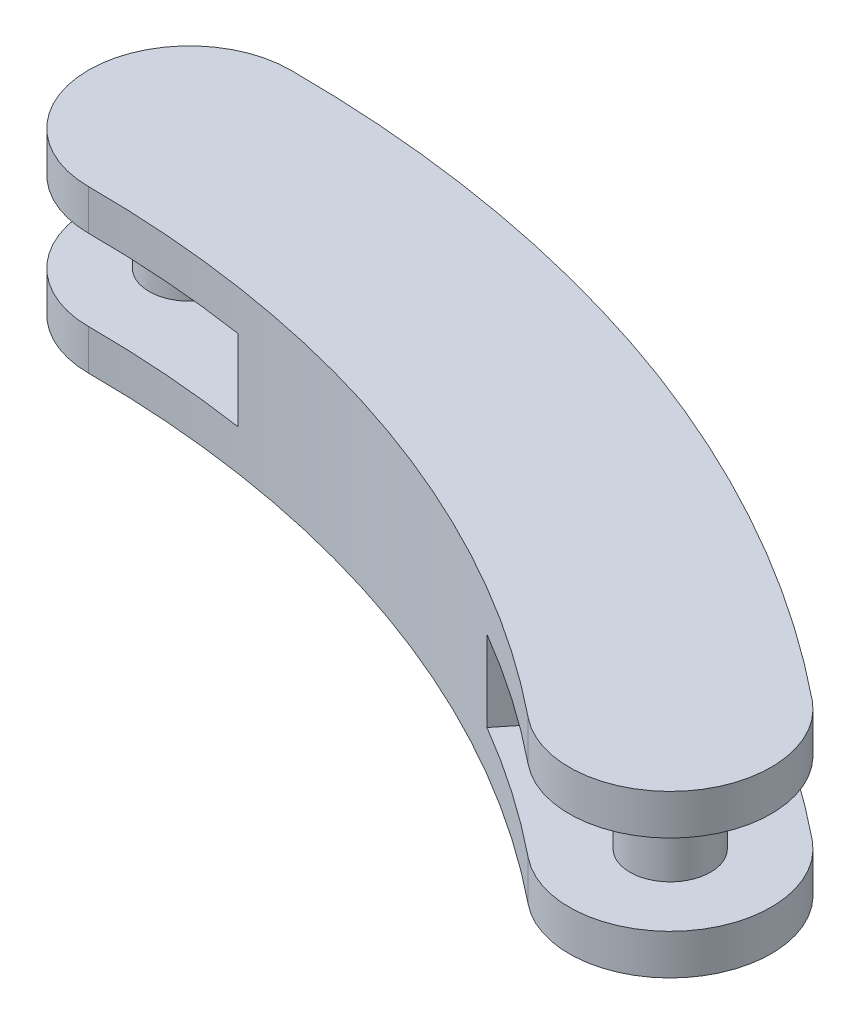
ISO-10303-21;
HEADER;
FILE_DESCRIPTION(('STEP AP214'),'2;1');
FILE_NAME('part.step','',(''),(''),'','','');
FILE_SCHEMA(('AUTOMOTIVE_DESIGN { 1 0 10303 214 1 1 1 1 }'));
ENDSEC;
DATA;
#1=APPLICATION_CONTEXT('core data for automotive mechanical design processes');
#2=APPLICATION_PROTOCOL_DEFINITION('international standard','automotive_design',2000,#1);
#3=PRODUCT_CONTEXT('',#1,'mechanical');
#4=PRODUCT('Part','Part','',(#3));
#5=PRODUCT_RELATED_PRODUCT_CATEGORY('part','',(#4));
#6=PRODUCT_DEFINITION_FORMATION('','',#4);
#7=PRODUCT_DEFINITION_CONTEXT('part definition',#1,'design');
#8=PRODUCT_DEFINITION('design','',#6,#7);
#9=PRODUCT_DEFINITION_SHAPE('','',#8);
#10=(LENGTH_UNIT() NAMED_UNIT(*) SI_UNIT(.MILLI.,.METRE.));
#11=(NAMED_UNIT(*) PLANE_ANGLE_UNIT() SI_UNIT($,.RADIAN.));
#12=(NAMED_UNIT(*) SI_UNIT($,.STERADIAN.) SOLID_ANGLE_UNIT());
#13=UNCERTAINTY_MEASURE_WITH_UNIT(LENGTH_MEASURE(1.E-05),#10,'distance_accuracy_value','');
#14=(GEOMETRIC_REPRESENTATION_CONTEXT(3) GLOBAL_UNCERTAINTY_ASSIGNED_CONTEXT((#13)) GLOBAL_UNIT_ASSIGNED_CONTEXT((#10,
#11,#12)) REPRESENTATION_CONTEXT('',''));
#15=CARTESIAN_POINT('',(0.,0.,0.));
#16=DIRECTION('',(0.,0.,1.));
#17=DIRECTION('',(1.,0.,0.));
#18=AXIS2_PLACEMENT_3D('',#15,#16,#17);
#19=CARTESIAN_POINT('',(0.,40.,227.93076923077));
#20=DIRECTION('',(0.,-1.,0.));
#21=DIRECTION('',(0.,0.,-1.));
#22=AXIS2_PLACEMENT_3D('',#19,#20,#21);
#23=CYLINDRICAL_SURFACE('',#22,267.93076923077);
#24=CARTESIAN_POINT('',(0.,10.,227.93076923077));
#25=DIRECTION('',(0.,1.,0.));
#26=DIRECTION('',(0.,0.,1.));
#27=AXIS2_PLACEMENT_3D('',#24,#25,#26);
#28=CIRCLE('',#27,267.93076923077);
#29=CARTESIAN_POINT('',(168.296630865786,10.,19.4526141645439));
#30=VERTEX_POINT('',#29);
#31=CARTESIAN_POINT('',(135.286366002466,10.,-3.33638423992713));
#32=VERTEX_POINT('',#31);
#33=EDGE_CURVE('E273',#30,#32,#28,.T.);
#34=ORIENTED_EDGE('',*,*,#33,.T.);
#35=DIRECTION('',(0.,-1.,0.));
#36=VECTOR('',#35,1.);
#37=CARTESIAN_POINT('',(135.286366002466,40.,-3.33638423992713));
#38=LINE('',#37,#36);
#39=CARTESIAN_POINT('',(135.286366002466,30.,-3.33638423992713));
#40=VERTEX_POINT('',#39);
#41=EDGE_CURVE('E138',#32,#40,#38,.F.);
#42=ORIENTED_EDGE('',*,*,#41,.T.);
#43=CARTESIAN_POINT('',(0.,30.,227.93076923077));
#44=DIRECTION('',(0.,1.,0.));
#45=DIRECTION('',(-1.,0.,0.));
#46=AXIS2_PLACEMENT_3D('',#43,#44,#45);
#47=CIRCLE('',#46,267.93076923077);
#48=CARTESIAN_POINT('',(168.296630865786,30.,19.4526141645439));
#49=VERTEX_POINT('',#48);
#50=EDGE_CURVE('E124',#49,#40,#47,.T.);
#51=ORIENTED_EDGE('',*,*,#50,.F.);
#52=DIRECTION('',(0.,-1.,0.));
#53=VECTOR('',#52,1.);
#54=CARTESIAN_POINT('',(168.296630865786,40.,19.452614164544));
#55=LINE('',#54,#53);
#56=CARTESIAN_POINT('',(168.296630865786,40.,19.452614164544));
#57=VERTEX_POINT('',#56);
#58=EDGE_CURVE('E135',#57,#49,#55,.T.);
#59=ORIENTED_EDGE('',*,*,#58,.F.);
#60=CARTESIAN_POINT('',(0.,40.,227.93076923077));
#61=DIRECTION('',(0.,-1.,0.));
#62=DIRECTION('',(0.,0.,-1.));
#63=AXIS2_PLACEMENT_3D('',#60,#61,#62);
#64=CIRCLE('',#63,267.93076923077);
#65=CARTESIAN_POINT('',(0.,40.,-39.9999999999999));
#66=VERTEX_POINT('',#65);
#67=EDGE_CURVE('E193',#66,#57,#64,.T.);
#68=ORIENTED_EDGE('',*,*,#67,.F.);
#69=DIRECTION('',(0.,-1.,0.));
#70=VECTOR('',#69,1.);
#71=CARTESIAN_POINT('',(0.,40.,-39.9999999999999));
#72=LINE('',#71,#70);
#73=CARTESIAN_POINT('',(0.,30.,-40.));
#74=VERTEX_POINT('',#73);
#75=EDGE_CURVE('E146',#66,#74,#72,.T.);
#76=ORIENTED_EDGE('',*,*,#75,.T.);
#77=CARTESIAN_POINT('',(0.,30.,227.93076923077));
#78=DIRECTION('',(0.,-1.,0.));
#79=DIRECTION('',(0.,0.,-1.));
#80=AXIS2_PLACEMENT_3D('',#77,#78,#79);
#81=CIRCLE('',#80,267.93076923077);
#82=CARTESIAN_POINT('',(40.,30.,-36.9973287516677));
#83=VERTEX_POINT('',#82);
#84=EDGE_CURVE('E185',#83,#74,#81,.F.);
#85=ORIENTED_EDGE('',*,*,#84,.F.);
#86=DIRECTION('',(0.,-1.,0.));
#87=VECTOR('',#86,1.);
#88=CARTESIAN_POINT('',(40.,40.,-36.9973287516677));
#89=LINE('',#88,#87);
#90=CARTESIAN_POINT('',(40.,10.,-36.9973287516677));
#91=VERTEX_POINT('',#90);
#92=EDGE_CURVE('E187',#91,#83,#89,.F.);
#93=ORIENTED_EDGE('',*,*,#92,.F.);
#94=CARTESIAN_POINT('',(0.,10.,227.93076923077));
#95=DIRECTION('',(0.,-1.,0.));
#96=DIRECTION('',(0.,0.,-1.));
#97=AXIS2_PLACEMENT_3D('',#94,#95,#96);
#98=CIRCLE('',#97,267.93076923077);
#99=CARTESIAN_POINT('',(0.,10.,-40.));
#100=VERTEX_POINT('',#99);
#101=EDGE_CURVE('E157',#91,#100,#98,.F.);
#102=ORIENTED_EDGE('',*,*,#101,.T.);
#103=CARTESIAN_POINT('',(0.,0.,-39.9999999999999));
#104=VERTEX_POINT('',#103);
#105=EDGE_CURVE('E143',#100,#104,#72,.T.);
#106=ORIENTED_EDGE('',*,*,#105,.T.);
#107=CARTESIAN_POINT('',(0.,0.,227.93076923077));
#108=DIRECTION('',(0.,-1.,0.));
#109=DIRECTION('',(0.,0.,-1.));
#110=AXIS2_PLACEMENT_3D('',#107,#108,#109);
#111=CIRCLE('',#110,267.93076923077);
#112=CARTESIAN_POINT('',(168.296630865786,0.,19.452614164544));
#113=VERTEX_POINT('',#112);
#114=EDGE_CURVE('E202',#104,#113,#111,.T.);
#115=ORIENTED_EDGE('',*,*,#114,.T.);
#116=EDGE_CURVE('E144',#30,#113,#55,.T.);
#117=ORIENTED_EDGE('',*,*,#116,.F.);
#118=EDGE_LOOP('',(#34,#42,#51,#59,#68,#76,#85,#93,#102,#106,#115,#117));
#119=FACE_BOUND('',#118,.T.);
#120=ADVANCED_FACE('F33',(#119),#23,.F.);
#121=CARTESIAN_POINT('',(0.,40.,227.93076923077));
#122=DIRECTION('',(0.,-1.,0.));
#123=DIRECTION('',(0.,0.,-1.));
#124=AXIS2_PLACEMENT_3D('',#121,#122,#123);
#125=CYLINDRICAL_SURFACE('',#124,317.93076923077);
#126=CARTESIAN_POINT('',(0.,10.,227.93076923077));
#127=DIRECTION('',(0.,1.,0.));
#128=DIRECTION('',(0.,0.,1.));
#129=AXIS2_PLACEMENT_3D('',#126,#127,#128);
#130=CIRCLE('',#129,317.93076923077);
#131=CARTESIAN_POINT('',(199.703369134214,10.,-19.452614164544));
#132=VERTEX_POINT('',#131);
#133=CARTESIAN_POINT('',(166.992324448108,10.,-42.6122728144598));
#134=VERTEX_POINT('',#133);
#135=EDGE_CURVE('E163',#132,#134,#130,.T.);
#136=ORIENTED_EDGE('',*,*,#135,.F.);
#137=DIRECTION('',(0.,-1.,0.));
#138=VECTOR('',#137,1.);
#139=CARTESIAN_POINT('',(199.703369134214,40.,-19.452614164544));
#140=LINE('',#139,#138);
#141=CARTESIAN_POINT('',(199.703369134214,0.,-19.452614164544));
#142=VERTEX_POINT('',#141);
#143=EDGE_CURVE('E211',#132,#142,#140,.T.);
#144=ORIENTED_EDGE('',*,*,#143,.T.);
#145=CARTESIAN_POINT('',(0.,0.,227.93076923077));
#146=DIRECTION('',(0.,1.,0.));
#147=DIRECTION('',(0.,0.,-1.));
#148=AXIS2_PLACEMENT_3D('',#145,#146,#147);
#149=CIRCLE('',#148,317.93076923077);
#150=CARTESIAN_POINT('',(0.,0.,-90.));
#151=VERTEX_POINT('',#150);
#152=EDGE_CURVE('E194',#142,#151,#149,.T.);
#153=ORIENTED_EDGE('',*,*,#152,.T.);
#154=DIRECTION('',(0.,-1.,0.));
#155=VECTOR('',#154,1.);
#156=CARTESIAN_POINT('',(0.,40.,-90.));
#157=LINE('',#156,#155);
#158=CARTESIAN_POINT('',(0.,10.,-90.));
#159=VERTEX_POINT('',#158);
#160=EDGE_CURVE('E199',#159,#151,#157,.T.);
#161=ORIENTED_EDGE('',*,*,#160,.F.);
#162=CARTESIAN_POINT('',(0.,10.,227.93076923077));
#163=DIRECTION('',(0.,-1.,0.));
#164=DIRECTION('',(0.,0.,-1.));
#165=AXIS2_PLACEMENT_3D('',#162,#163,#164);
#166=CIRCLE('',#165,317.93076923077);
#167=CARTESIAN_POINT('',(40.,10.,-87.4736917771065));
#168=VERTEX_POINT('',#167);
#169=EDGE_CURVE('E175',#159,#168,#166,.T.);
#170=ORIENTED_EDGE('',*,*,#169,.T.);
#171=DIRECTION('',(0.,-1.,0.));
#172=VECTOR('',#171,1.);
#173=CARTESIAN_POINT('',(40.,40.,-87.4736917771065));
#174=LINE('',#173,#172);
#175=CARTESIAN_POINT('',(40.,30.,-87.4736917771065));
#176=VERTEX_POINT('',#175);
#177=EDGE_CURVE('E41',#176,#168,#174,.T.);
#178=ORIENTED_EDGE('',*,*,#177,.F.);
#179=CARTESIAN_POINT('',(0.,30.,227.93076923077));
#180=DIRECTION('',(0.,-1.,0.));
#181=DIRECTION('',(0.,0.,-1.));
#182=AXIS2_PLACEMENT_3D('',#179,#180,#181);
#183=CIRCLE('',#182,317.93076923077);
#184=CARTESIAN_POINT('',(0.,30.,-90.));
#185=VERTEX_POINT('',#184);
#186=EDGE_CURVE('E156',#185,#176,#183,.T.);
#187=ORIENTED_EDGE('',*,*,#186,.F.);
#188=CARTESIAN_POINT('',(0.,40.,-90.));
#189=VERTEX_POINT('',#188);
#190=EDGE_CURVE('E209',#189,#185,#157,.T.);
#191=ORIENTED_EDGE('',*,*,#190,.F.);
#192=CARTESIAN_POINT('',(0.,40.,227.93076923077));
#193=DIRECTION('',(0.,1.,0.));
#194=DIRECTION('',(0.,0.,-1.));
#195=AXIS2_PLACEMENT_3D('',#192,#193,#194);
#196=CIRCLE('',#195,317.93076923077);
#197=CARTESIAN_POINT('',(199.703369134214,40.,-19.452614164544));
#198=VERTEX_POINT('',#197);
#199=EDGE_CURVE('E197',#198,#189,#196,.T.);
#200=ORIENTED_EDGE('',*,*,#199,.F.);
#201=CARTESIAN_POINT('',(199.703369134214,30.,-19.452614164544));
#202=VERTEX_POINT('',#201);
#203=EDGE_CURVE('E148',#198,#202,#140,.T.);
#204=ORIENTED_EDGE('',*,*,#203,.T.);
#205=CARTESIAN_POINT('',(0.,30.,227.93076923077));
#206=DIRECTION('',(0.,1.,0.));
#207=DIRECTION('',(-1.,0.,0.));
#208=AXIS2_PLACEMENT_3D('',#205,#206,#207);
#209=CIRCLE('',#208,317.93076923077);
#210=CARTESIAN_POINT('',(166.992324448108,30.,-42.6122728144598));
#211=VERTEX_POINT('',#210);
#212=EDGE_CURVE('E48',#202,#211,#209,.T.);
#213=ORIENTED_EDGE('',*,*,#212,.T.);
#214=DIRECTION('',(0.,-1.,0.));
#215=VECTOR('',#214,1.);
#216=CARTESIAN_POINT('',(166.992324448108,40.,-42.6122728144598));
#217=LINE('',#216,#215);
#218=EDGE_CURVE('E11',#134,#211,#217,.F.);
#219=ORIENTED_EDGE('',*,*,#218,.F.);
#220=EDGE_LOOP('',(#136,#144,#153,#161,#170,#178,#187,#191,#200,#204,#213,#219));
#221=FACE_BOUND('',#220,.T.);
#222=ADVANCED_FACE('F223',(#221),#125,.T.);
#223=CARTESIAN_POINT('',(184.,40.,0.));
#224=DIRECTION('',(0.,-1.,0.));
#225=DIRECTION('',(0.,0.,-1.));
#226=AXIS2_PLACEMENT_3D('',#223,#224,#225);
#227=CYLINDRICAL_SURFACE('',#226,25.);
#228=CARTESIAN_POINT('',(184.,10.,0.));
#229=DIRECTION('',(0.,1.,0.));
#230=DIRECTION('',(0.,0.,1.));
#231=AXIS2_PLACEMENT_3D('',#228,#229,#230);
#232=CIRCLE('',#231,25.);
#233=EDGE_CURVE('E160',#30,#132,#232,.T.);
#234=ORIENTED_EDGE('',*,*,#233,.F.);
#235=ORIENTED_EDGE('',*,*,#116,.T.);
#236=CARTESIAN_POINT('',(184.,0.,0.));
#237=DIRECTION('',(0.,1.,0.));
#238=DIRECTION('',(0.,0.,1.));
#239=AXIS2_PLACEMENT_3D('',#236,#237,#238);
#240=CIRCLE('',#239,25.);
#241=EDGE_CURVE('E205',#113,#142,#240,.T.);
#242=ORIENTED_EDGE('',*,*,#241,.T.);
#243=ORIENTED_EDGE('',*,*,#143,.F.);
#244=EDGE_LOOP('',(#234,#235,#242,#243));
#245=FACE_BOUND('',#244,.T.);
#246=ADVANCED_FACE('F256',(#245),#227,.T.);
#247=CARTESIAN_POINT('',(0.,40.,-65.));
#248=DIRECTION('',(0.,-1.,0.));
#249=DIRECTION('',(0.,0.,-1.));
#250=AXIS2_PLACEMENT_3D('',#247,#248,#249);
#251=CYLINDRICAL_SURFACE('',#250,25.);
#252=CARTESIAN_POINT('',(0.,30.,-65.));
#253=DIRECTION('',(0.,-1.,0.));
#254=DIRECTION('',(0.,0.,-1.));
#255=AXIS2_PLACEMENT_3D('',#252,#253,#254);
#256=CIRCLE('',#255,25.);
#257=EDGE_CURVE('E183',#74,#185,#256,.T.);
#258=ORIENTED_EDGE('',*,*,#257,.F.);
#259=ORIENTED_EDGE('',*,*,#75,.F.);
#260=CARTESIAN_POINT('',(0.,40.,-65.));
#261=DIRECTION('',(0.,1.,0.));
#262=DIRECTION('',(0.,0.,1.));
#263=AXIS2_PLACEMENT_3D('',#260,#261,#262);
#264=CIRCLE('',#263,25.);
#265=EDGE_CURVE('E190',#189,#66,#264,.T.);
#266=ORIENTED_EDGE('',*,*,#265,.F.);
#267=ORIENTED_EDGE('',*,*,#190,.T.);
#268=EDGE_LOOP('',(#258,#259,#266,#267));
#269=FACE_BOUND('',#268,.T.);
#270=ADVANCED_FACE('F35',(#269),#251,.T.);
#271=ORIENTED_EDGE('',*,*,#105,.F.);
#272=CARTESIAN_POINT('',(0.,10.,-65.));
#273=DIRECTION('',(0.,-1.,0.));
#274=DIRECTION('',(0.,0.,-1.));
#275=AXIS2_PLACEMENT_3D('',#272,#273,#274);
#276=CIRCLE('',#275,25.);
#277=EDGE_CURVE('E178',#100,#159,#276,.T.);
#278=ORIENTED_EDGE('',*,*,#277,.T.);
#279=ORIENTED_EDGE('',*,*,#160,.T.);
#280=CARTESIAN_POINT('',(0.,0.,-65.));
#281=DIRECTION('',(0.,1.,0.));
#282=DIRECTION('',(0.,0.,1.));
#283=AXIS2_PLACEMENT_3D('',#280,#281,#282);
#284=CIRCLE('',#283,25.);
#285=EDGE_CURVE('E189',#151,#104,#284,.T.);
#286=ORIENTED_EDGE('',*,*,#285,.T.);
#287=EDGE_LOOP('',(#271,#278,#279,#286));
#288=FACE_BOUND('',#287,.T.);
#289=ADVANCED_FACE('F219',(#288),#251,.T.);
#290=CARTESIAN_POINT('',(0.,40.,81.4653846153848));
#291=DIRECTION('',(0.,1.,0.));
#292=DIRECTION('',(0.,0.,1.));
#293=AXIS2_PLACEMENT_3D('',#290,#291,#292);
#294=PLANE('',#293);
#295=ORIENTED_EDGE('',*,*,#265,.T.);
#296=ORIENTED_EDGE('',*,*,#67,.T.);
#297=CARTESIAN_POINT('',(184.,40.,0.));
#298=DIRECTION('',(0.,1.,0.));
#299=DIRECTION('',(0.,0.,1.));
#300=AXIS2_PLACEMENT_3D('',#297,#298,#299);
#301=CIRCLE('',#300,25.);
#302=EDGE_CURVE('E142',#57,#198,#301,.T.);
#303=ORIENTED_EDGE('',*,*,#302,.T.);
#304=ORIENTED_EDGE('',*,*,#199,.T.);
#305=EDGE_LOOP('',(#295,#296,#303,#304));
#306=FACE_BOUND('',#305,.T.);
#307=ADVANCED_FACE('F243',(#306),#294,.T.);
#308=CARTESIAN_POINT('',(0.,0.,81.4653846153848));
#309=DIRECTION('',(0.,1.,0.));
#310=DIRECTION('',(0.,0.,1.));
#311=AXIS2_PLACEMENT_3D('',#308,#309,#310);
#312=PLANE('',#311);
#313=ORIENTED_EDGE('',*,*,#285,.F.);
#314=ORIENTED_EDGE('',*,*,#152,.F.);
#315=ORIENTED_EDGE('',*,*,#241,.F.);
#316=ORIENTED_EDGE('',*,*,#114,.F.);
#317=EDGE_LOOP('',(#313,#314,#315,#316));
#318=FACE_BOUND('',#317,.T.);
#319=ADVANCED_FACE('F228',(#318),#312,.F.);
#320=ORIENTED_EDGE('',*,*,#58,.T.);
#321=CARTESIAN_POINT('',(184.,30.,0.));
#322=DIRECTION('',(0.,1.,0.));
#323=DIRECTION('',(-1.,0.,0.));
#324=AXIS2_PLACEMENT_3D('',#321,#322,#323);
#325=CIRCLE('',#324,25.);
#326=EDGE_CURVE('E121',#49,#202,#325,.T.);
#327=ORIENTED_EDGE('',*,*,#326,.T.);
#328=ORIENTED_EDGE('',*,*,#203,.F.);
#329=ORIENTED_EDGE('',*,*,#302,.F.);
#330=EDGE_LOOP('',(#320,#327,#328,#329));
#331=FACE_BOUND('',#330,.T.);
#332=ADVANCED_FACE('F141',(#331),#227,.T.);
#333=CARTESIAN_POINT('',(40.,30.,-90.));
#334=DIRECTION('',(-1.,0.,0.));
#335=DIRECTION('',(0.,0.,1.));
#336=AXIS2_PLACEMENT_3D('',#333,#334,#335);
#337=PLANE('',#336);
#338=ORIENTED_EDGE('',*,*,#92,.T.);
#339=DIRECTION('',(0.,0.,1.));
#340=VECTOR('',#339,1.);
#341=CARTESIAN_POINT('',(40.,30.,-90.));
#342=LINE('',#341,#340);
#343=EDGE_CURVE('E172',#176,#83,#342,.T.);
#344=ORIENTED_EDGE('',*,*,#343,.F.);
#345=ORIENTED_EDGE('',*,*,#177,.T.);
#346=DIRECTION('',(0.,0.,1.));
#347=VECTOR('',#346,1.);
#348=CARTESIAN_POINT('',(40.,10.,-90.));
#349=LINE('',#348,#347);
#350=EDGE_CURVE('E56',#168,#91,#349,.T.);
#351=ORIENTED_EDGE('',*,*,#350,.T.);
#352=EDGE_LOOP('',(#338,#344,#345,#351));
#353=FACE_BOUND('',#352,.T.);
#354=ADVANCED_FACE('F234',(#353),#337,.T.);
#355=CARTESIAN_POINT('',(-25.,30.,-90.));
#356=DIRECTION('',(0.,-1.,0.));
#357=DIRECTION('',(0.,0.,-1.));
#358=AXIS2_PLACEMENT_3D('',#355,#356,#357);
#359=PLANE('',#358);
#360=CARTESIAN_POINT('',(0.,30.,-65.));
#361=DIRECTION('',(0.,-1.,0.));
#362=DIRECTION('',(0.,0.,-1.));
#363=AXIS2_PLACEMENT_3D('',#360,#361,#362);
#364=CIRCLE('',#363,10.);
#365=CARTESIAN_POINT('',(0.,30.,-75.));
#366=VERTEX_POINT('',#365);
#367=EDGE_CURVE('E153',#366,#366,#364,.T.);
#368=ORIENTED_EDGE('',*,*,#367,.F.);
#369=EDGE_LOOP('',(#368));
#370=FACE_BOUND('',#369,.T.);
#371=ORIENTED_EDGE('',*,*,#84,.T.);
#372=ORIENTED_EDGE('',*,*,#257,.T.);
#373=ORIENTED_EDGE('',*,*,#186,.T.);
#374=ORIENTED_EDGE('',*,*,#343,.T.);
#375=EDGE_LOOP('',(#371,#372,#373,#374));
#376=FACE_BOUND('',#375,.T.);
#377=ADVANCED_FACE('F240',(#370,#376),#359,.T.);
#378=CARTESIAN_POINT('',(-25.,10.,-90.));
#379=DIRECTION('',(0.,-1.,0.));
#380=DIRECTION('',(0.,0.,-1.));
#381=AXIS2_PLACEMENT_3D('',#378,#379,#380);
#382=PLANE('',#381);
#383=CARTESIAN_POINT('',(0.,10.,-65.));
#384=DIRECTION('',(0.,-1.,0.));
#385=DIRECTION('',(0.,0.,-1.));
#386=AXIS2_PLACEMENT_3D('',#383,#384,#385);
#387=CIRCLE('',#386,10.);
#388=CARTESIAN_POINT('',(0.,10.,-75.));
#389=VERTEX_POINT('',#388);
#390=EDGE_CURVE('E139',#389,#389,#387,.T.);
#391=ORIENTED_EDGE('',*,*,#390,.T.);
#392=EDGE_LOOP('',(#391));
#393=FACE_BOUND('',#392,.T.);
#394=ORIENTED_EDGE('',*,*,#350,.F.);
#395=ORIENTED_EDGE('',*,*,#169,.F.);
#396=ORIENTED_EDGE('',*,*,#277,.F.);
#397=ORIENTED_EDGE('',*,*,#101,.F.);
#398=EDGE_LOOP('',(#394,#395,#396,#397));
#399=FACE_BOUND('',#398,.T.);
#400=ADVANCED_FACE('F232',(#393,#399),#382,.F.);
#401=CARTESIAN_POINT('',(58.1944345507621,30.,92.1615681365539));
#402=DIRECTION('',(0.77810456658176,0.,0.628134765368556));
#403=DIRECTION('',(0.628134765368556,0.,-0.77810456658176));
#404=AXIS2_PLACEMENT_3D('',#401,#402,#403);
#405=PLANE('',#404);
#406=ORIENTED_EDGE('',*,*,#218,.T.);
#407=DIRECTION('',(0.628134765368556,0.,-0.77810456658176));
#408=VECTOR('',#407,1.);
#409=CARTESIAN_POINT('',(58.1944345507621,30.,92.1615681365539));
#410=LINE('',#409,#408);
#411=EDGE_CURVE('E276',#40,#211,#410,.T.);
#412=ORIENTED_EDGE('',*,*,#411,.F.);
#413=ORIENTED_EDGE('',*,*,#41,.F.);
#414=DIRECTION('',(0.628134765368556,0.,-0.77810456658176));
#415=VECTOR('',#414,1.);
#416=CARTESIAN_POINT('',(58.1944345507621,10.,92.1615681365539));
#417=LINE('',#416,#415);
#418=EDGE_CURVE('E130',#32,#134,#417,.T.);
#419=ORIENTED_EDGE('',*,*,#418,.T.);
#420=EDGE_LOOP('',(#406,#412,#413,#419));
#421=FACE_BOUND('',#420,.T.);
#422=ADVANCED_FACE('F275',(#421),#405,.T.);
#423=CARTESIAN_POINT('',(58.1944345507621,10.,92.1615681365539));
#424=DIRECTION('',(0.,1.,0.));
#425=DIRECTION('',(0.,0.,1.));
#426=AXIS2_PLACEMENT_3D('',#423,#424,#425);
#427=PLANE('',#426);
#428=CARTESIAN_POINT('',(184.,10.,0.));
#429=DIRECTION('',(0.,1.,0.));
#430=DIRECTION('',(0.,0.,1.));
#431=AXIS2_PLACEMENT_3D('',#428,#429,#430);
#432=CIRCLE('',#431,10.);
#433=CARTESIAN_POINT('',(184.,10.,10.));
#434=VERTEX_POINT('',#433);
#435=EDGE_CURVE('E158',#434,#434,#432,.T.);
#436=ORIENTED_EDGE('',*,*,#435,.F.);
#437=EDGE_LOOP('',(#436));
#438=FACE_BOUND('',#437,.T.);
#439=ORIENTED_EDGE('',*,*,#135,.T.);
#440=ORIENTED_EDGE('',*,*,#418,.F.);
#441=ORIENTED_EDGE('',*,*,#33,.F.);
#442=ORIENTED_EDGE('',*,*,#233,.T.);
#443=EDGE_LOOP('',(#439,#440,#441,#442));
#444=FACE_BOUND('',#443,.T.);
#445=ADVANCED_FACE('F271',(#438,#444),#427,.T.);
#446=CARTESIAN_POINT('',(58.1944345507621,30.,92.1615681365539));
#447=DIRECTION('',(0.,1.,0.));
#448=DIRECTION('',(-1.,0.,0.));
#449=AXIS2_PLACEMENT_3D('',#446,#447,#448);
#450=PLANE('',#449);
#451=CARTESIAN_POINT('',(184.,30.,0.));
#452=DIRECTION('',(0.,1.,0.));
#453=DIRECTION('',(-1.,0.,0.));
#454=AXIS2_PLACEMENT_3D('',#451,#452,#453);
#455=CIRCLE('',#454,10.);
#456=CARTESIAN_POINT('',(174.,30.,0.));
#457=VERTEX_POINT('',#456);
#458=EDGE_CURVE('E283',#457,#457,#455,.T.);
#459=ORIENTED_EDGE('',*,*,#458,.T.);
#460=EDGE_LOOP('',(#459));
#461=FACE_BOUND('',#460,.T.);
#462=ORIENTED_EDGE('',*,*,#326,.F.);
#463=ORIENTED_EDGE('',*,*,#50,.T.);
#464=ORIENTED_EDGE('',*,*,#411,.T.);
#465=ORIENTED_EDGE('',*,*,#212,.F.);
#466=EDGE_LOOP('',(#462,#463,#464,#465));
#467=FACE_BOUND('',#466,.T.);
#468=ADVANCED_FACE('F123',(#461,#467),#450,.F.);
#469=CARTESIAN_POINT('',(0.,0.,-65.));
#470=DIRECTION('',(0.,1.,0.));
#471=DIRECTION('',(0.,0.,1.));
#472=AXIS2_PLACEMENT_3D('',#469,#470,#471);
#473=CYLINDRICAL_SURFACE('',#472,10.);
#474=ORIENTED_EDGE('',*,*,#367,.T.);
#475=EDGE_LOOP('',(#474));
#476=FACE_BOUND('',#475,.T.);
#477=ORIENTED_EDGE('',*,*,#390,.F.);
#478=EDGE_LOOP('',(#477));
#479=FACE_BOUND('',#478,.T.);
#480=ADVANCED_FACE('F290',(#476,#479),#473,.T.);
#481=CARTESIAN_POINT('',(184.,0.,0.));
#482=DIRECTION('',(0.,1.,0.));
#483=DIRECTION('',(0.,0.,1.));
#484=AXIS2_PLACEMENT_3D('',#481,#482,#483);
#485=CYLINDRICAL_SURFACE('',#484,10.);
#486=ORIENTED_EDGE('',*,*,#435,.T.);
#487=EDGE_LOOP('',(#486));
#488=FACE_BOUND('',#487,.T.);
#489=ORIENTED_EDGE('',*,*,#458,.F.);
#490=EDGE_LOOP('',(#489));
#491=FACE_BOUND('',#490,.T.);
#492=ADVANCED_FACE('F288',(#488,#491),#485,.T.);
#493=CLOSED_SHELL('',(#120,#222,#246,#270,#289,#307,#319,#332,#354,#377,#400,#422,#445,#468,
#480,#492));
#494=MANIFOLD_SOLID_BREP('B2',#493);
#495=ADVANCED_BREP_SHAPE_REPRESENTATION('',(#18,#494),#14);
#496=SHAPE_DEFINITION_REPRESENTATION(#9,#495);
ENDSEC;
END-ISO-10303-21;
